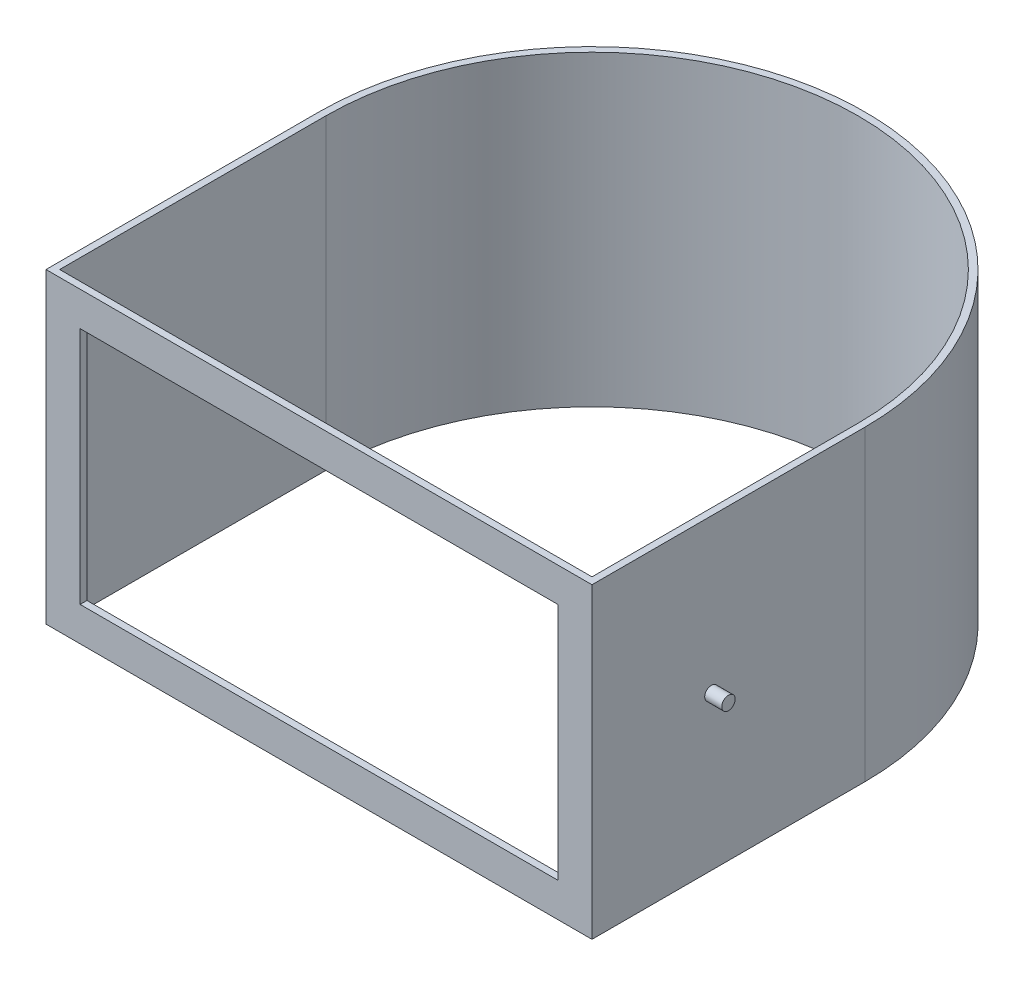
from build123d import *

# Parameters (mm, degrees)
BOSS_EXTRUDE1_DEPTH      = 114.3
SHELL1_T                 = -2.54
BOSS_EXTRUDE2_DEPTH      = 207.01
BOSS_EXTRUDE2_DEPTH_BACK = 8.89
SKETCH7_R                = 2.5
SKETCH8_R                = 2.5
BOSS_EXTRUDE3_DEPTH      = 207.01
CUT_EXTRUDE1_DEPTH       = 190.200165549
CUT_EXTRUDE1_DEPTH_BACK  = 190.200165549
SKETCH10_R               = 99.06
SKETCH10_W               = 198.12
SKETCH10_H               = 99.06
SKETCH11_W               = 177.8
SKETCH11_H               = 88.9
CUT_EXTRUDE2_DEPTH       = 2.54


with BuildPart() as part:
    # Sketch1 → Boss-Extrude1 (new body)
    with BuildSketch(Plane(origin=(0, 0, 0), x_dir=(1, 0, 0), z_dir=(0, 1, 0))):
        with BuildLine():
            ThreePointArc((101.6, 0), (0, 101.6), (-101.6, 0))
            Line((-101.6, 0), (101.6, 0))
        make_face()
        with BuildLine():
            Line((101.6, 0), (-101.6, 0))
            ThreePointArc((-101.6, 0), (-71.842048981, -71.842048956), (-3.5e-08, -101.6))
            ThreePointArc((-3.5e-08, -101.6), (71.842048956, -71.842048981), (101.6, 0))
        make_face()
        with BuildLine():
            ThreePointArc((-3.5e-08, -101.6), (-71.842048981, -71.842048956), (-101.6, 0))
            Line((-101.6, 0), (-101.6, -101.6))
            Line((-101.6, -101.6), (-3.5e-08, -101.6))
        make_face()
        with BuildLine():
            ThreePointArc((101.6, 0), (0, 101.6), (-101.6, 0))
            Line((-101.6, 0), (101.6, 0))
        make_face()
        with BuildLine():
            Line((101.6, 0), (-101.6, 0))
            ThreePointArc((-101.6, 0), (-71.842048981, -71.842048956), (-3.5e-08, -101.6))
            ThreePointArc((-3.5e-08, -101.6), (71.842048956, -71.842048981), (101.6, 0))
        make_face()
        with BuildLine():
            Line((101.6, -101.6), (101.6, 0))
            ThreePointArc((101.6, 0), (71.842048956, -71.842048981), (-3.5e-08, -101.6))
            Line((-3.5e-08, -101.6), (101.6, -101.6))
        make_face()
    extrude(amount=BOSS_EXTRUDE1_DEPTH)

    # Shell1
    shell1_openings = [part.faces().sort_by_distance(p)[0] for p in [
        (0, 114.3, 9.484345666),
    ]]
    offset(amount=SHELL1_T, openings=shell1_openings, kind=Kind.INTERSECTION)

    # Sketch7 → Boss-Extrude2 (add, two sides: drawn at the far end of the back side and taken through both)
    with BuildSketch(Plane(origin=(-99.06, 0, 0), x_dir=(0, 0, -1), z_dir=(1, 0, 0)).offset(-BOSS_EXTRUDE2_DEPTH_BACK)):
        with Locations((-57.15, 57.15)):
            Circle(SKETCH7_R)
    extrude(amount=BOSS_EXTRUDE2_DEPTH + BOSS_EXTRUDE2_DEPTH_BACK)

    # Sketch8 → Boss-Extrude3 (add)
    with BuildSketch(Plane(origin=(0, 0, 99.06), x_dir=(-1, 0, 0), z_dir=(0, 0, -1))):
        with Locations(Location((0, 57.15, 0), (0, 0, 180))):
            Circle(SKETCH8_R)
    extrude(amount=BOSS_EXTRUDE3_DEPTH)

    # Sketch10 → Cut-Extrude1 (cut, two sides: drawn at the far end of the back side and taken through both)
    with BuildSketch(Plane(origin=(0, 2.54, 0), x_dir=(1, 0, 0), z_dir=(0, 1, 0)).offset(-CUT_EXTRUDE1_DEPTH_BACK)):
        Circle(SKETCH10_R)
        with Locations((0, -49.53)):
            Rectangle(SKETCH10_W, SKETCH10_H)
    extrude(amount=CUT_EXTRUDE1_DEPTH + CUT_EXTRUDE1_DEPTH_BACK, mode=Mode.SUBTRACT)

    # Sketch11 → Cut-Extrude2 (cut)
    with BuildSketch(Plane.XY.offset(101.6)):
        with Locations((0, 57.15)):
            Rectangle(SKETCH11_W, SKETCH11_H)
    extrude(amount=-CUT_EXTRUDE2_DEPTH, mode=Mode.SUBTRACT)


solid = part.part
